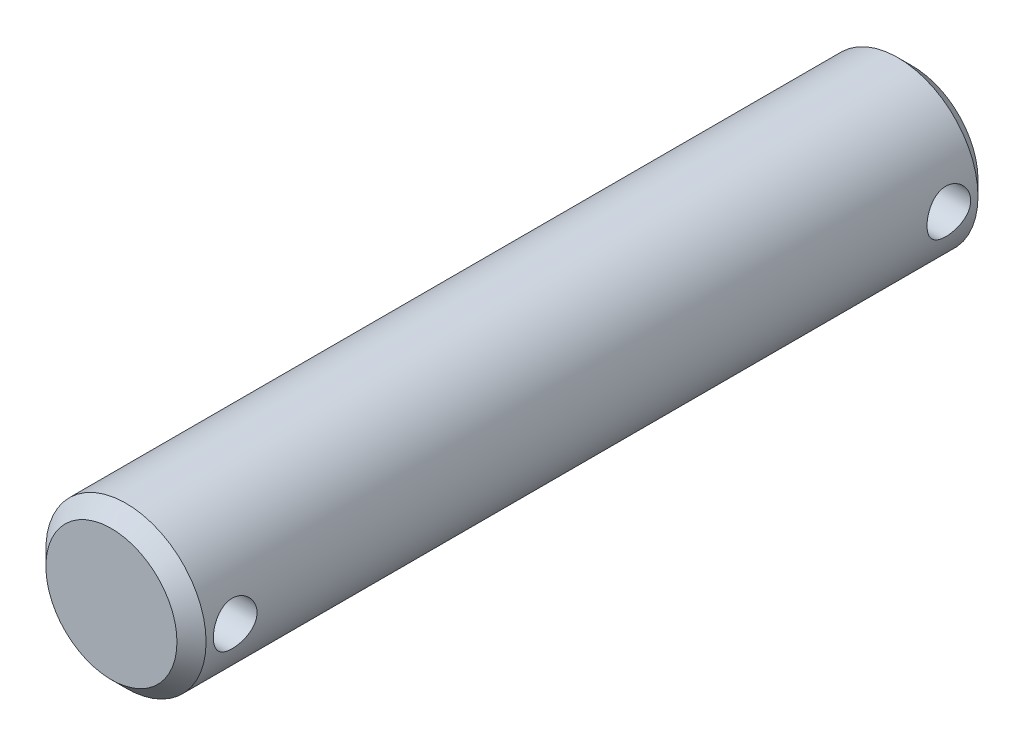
from build123d import *

# Parameters (mm, degrees)
ESQUISSE1_R             = 11
BASE_EXTRUSION_DEPTH    = 110
CHANFREIN1_SIZE         = 2
ESQUISSE2_R             = 3
ENL_V_MAT_EXTRU_1_DEPTH = 50


with BuildPart() as part:
    # Esquisse1 → Base-Extrusion (new body)
    with BuildSketch(Plane.XY):
        Circle(ESQUISSE1_R)
    extrude(amount=-BASE_EXTRUSION_DEPTH)

    # Chanfrein1
    chanfrein1_edges = [part.edges().sort_by_distance(p)[0] for p in [
        (-11, 0, 0),
        (-11, 0, -110),
    ]]
    chamfer(chanfrein1_edges, length=CHANFREIN1_SIZE)

    # Esquisse2 → Enl_v. mat.-Extru.1 (cut, symmetric)
    with BuildSketch(Plane(origin=(0, 0, 0), x_dir=(0, 0, -1), z_dir=(1, 0, 0))):
        with Locations((6, 0)):
            Circle(ESQUISSE2_R)
        with Locations((104, 0)):
            Circle(ESQUISSE2_R)
    extrude(amount=ENL_V_MAT_EXTRU_1_DEPTH, both=True, mode=Mode.SUBTRACT)


solid = part.part
